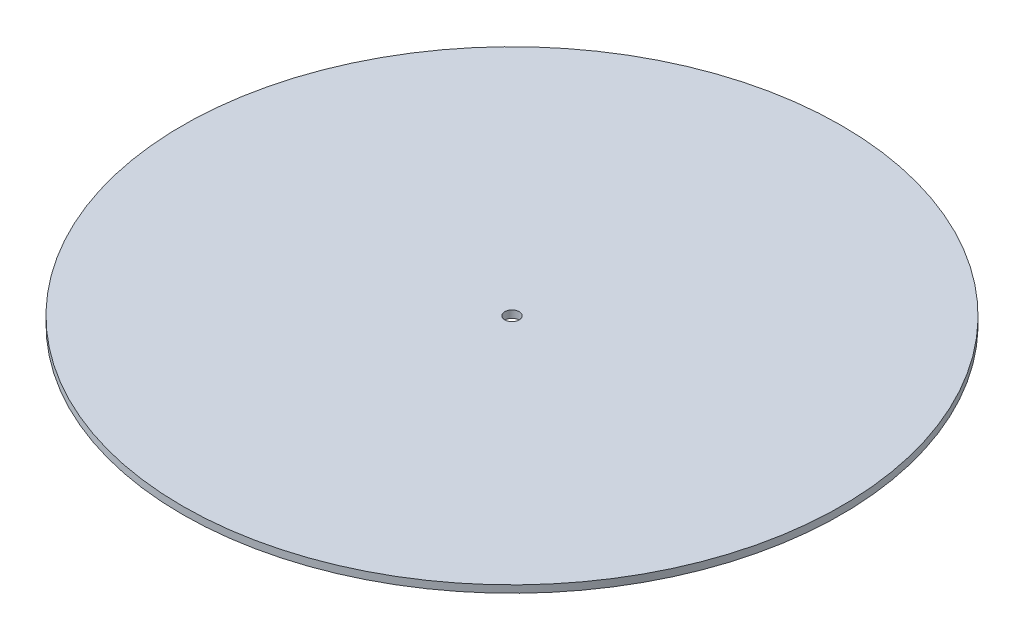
from build123d import *

# Parameters (mm, degrees)
SKETCH1_R           = 114.7445
SKETCH1_R_2         = 2.499995
BOSS_EXTRUDE1_DEPTH = 2.54


with BuildPart() as part:
    # Sketch1 → Boss-Extrude1 (new body)
    with BuildSketch(Plane(origin=(0, 0, 0), x_dir=(1, 0, 0), z_dir=(0, 1, 0))):
        with Locations(Location((0, 0, 0), (0, 0, 270))):
            Circle(SKETCH1_R)
        with Locations(Location((0, 0, 0), (0, 0, 270))):
            Circle(SKETCH1_R_2, mode=Mode.SUBTRACT)
    extrude(amount=BOSS_EXTRUDE1_DEPTH)


solid = part.part
